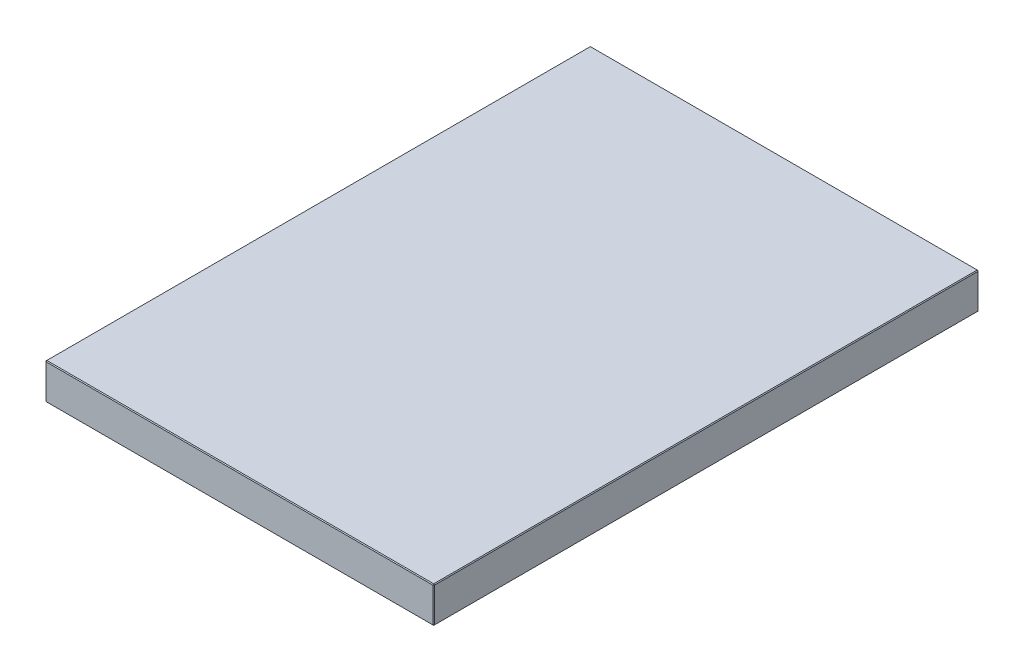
ISO-10303-21;
HEADER;
FILE_DESCRIPTION(('STEP AP214'),'2;1');
FILE_NAME('part.step','',(''),(''),'','','');
FILE_SCHEMA(('AUTOMOTIVE_DESIGN { 1 0 10303 214 1 1 1 1 }'));
ENDSEC;
DATA;
#1=APPLICATION_CONTEXT('core data for automotive mechanical design processes');
#2=APPLICATION_PROTOCOL_DEFINITION('international standard','automotive_design',2000,#1);
#3=PRODUCT_CONTEXT('',#1,'mechanical');
#4=PRODUCT('Part','Part','',(#3));
#5=PRODUCT_RELATED_PRODUCT_CATEGORY('part','',(#4));
#6=PRODUCT_DEFINITION_FORMATION('','',#4);
#7=PRODUCT_DEFINITION_CONTEXT('part definition',#1,'design');
#8=PRODUCT_DEFINITION('design','',#6,#7);
#9=PRODUCT_DEFINITION_SHAPE('','',#8);
#10=(LENGTH_UNIT() NAMED_UNIT(*) SI_UNIT(.MILLI.,.METRE.));
#11=(NAMED_UNIT(*) PLANE_ANGLE_UNIT() SI_UNIT($,.RADIAN.));
#12=(NAMED_UNIT(*) SI_UNIT($,.STERADIAN.) SOLID_ANGLE_UNIT());
#13=UNCERTAINTY_MEASURE_WITH_UNIT(LENGTH_MEASURE(1.E-05),#10,'distance_accuracy_value','');
#14=(GEOMETRIC_REPRESENTATION_CONTEXT(3) GLOBAL_UNCERTAINTY_ASSIGNED_CONTEXT((#13)) GLOBAL_UNIT_ASSIGNED_CONTEXT((#10,
#11,#12)) REPRESENTATION_CONTEXT('',''));
#15=CARTESIAN_POINT('',(0.,0.,0.));
#16=DIRECTION('',(0.,0.,1.));
#17=DIRECTION('',(1.,0.,0.));
#18=AXIS2_PLACEMENT_3D('',#15,#16,#17);
#19=CARTESIAN_POINT('',(-248.,46.,348.));
#20=DIRECTION('',(1.,0.,0.));
#21=DIRECTION('',(0.,0.,-1.));
#22=AXIS2_PLACEMENT_3D('',#19,#20,#21);
#23=PLANE('',#22);
#24=DIRECTION('',(0.,-1.,0.));
#25=VECTOR('',#24,1.);
#26=CARTESIAN_POINT('',(-248.,46.,-347.));
#27=LINE('',#26,#25);
#28=CARTESIAN_POINT('',(-248.,45.,-347.));
#29=VERTEX_POINT('',#28);
#30=CARTESIAN_POINT('',(-248.,1.,-347.));
#31=VERTEX_POINT('',#30);
#32=EDGE_CURVE('E115',#29,#31,#27,.T.);
#33=ORIENTED_EDGE('',*,*,#32,.T.);
#34=DIRECTION('',(0.,0.,1.));
#35=VECTOR('',#34,1.);
#36=CARTESIAN_POINT('',(-248.,1.,348.));
#37=LINE('',#36,#35);
#38=CARTESIAN_POINT('',(-248.,1.,347.));
#39=VERTEX_POINT('',#38);
#40=EDGE_CURVE('E111',#31,#39,#37,.T.);
#41=ORIENTED_EDGE('',*,*,#40,.T.);
#42=DIRECTION('',(0.,1.,0.));
#43=VECTOR('',#42,1.);
#44=CARTESIAN_POINT('',(-248.,46.,347.));
#45=LINE('',#44,#43);
#46=CARTESIAN_POINT('',(-248.,45.,347.));
#47=VERTEX_POINT('',#46);
#48=EDGE_CURVE('E104',#39,#47,#45,.T.);
#49=ORIENTED_EDGE('',*,*,#48,.T.);
#50=DIRECTION('',(0.,0.,-1.));
#51=VECTOR('',#50,1.);
#52=CARTESIAN_POINT('',(-248.,45.,-348.));
#53=LINE('',#52,#51);
#54=EDGE_CURVE('E108',#47,#29,#53,.T.);
#55=ORIENTED_EDGE('',*,*,#54,.T.);
#56=EDGE_LOOP('',(#33,#41,#49,#55));
#57=FACE_BOUND('',#56,.T.);
#58=ADVANCED_FACE('F16',(#57),#23,.F.);
#59=CARTESIAN_POINT('',(248.,46.,348.));
#60=DIRECTION('',(0.,0.,-1.));
#61=DIRECTION('',(-1.,0.,0.));
#62=AXIS2_PLACEMENT_3D('',#59,#60,#61);
#63=PLANE('',#62);
#64=DIRECTION('',(-1.,0.,0.));
#65=VECTOR('',#64,1.);
#66=CARTESIAN_POINT('',(-248.,45.,348.));
#67=LINE('',#66,#65);
#68=CARTESIAN_POINT('',(247.,45.,348.));
#69=VERTEX_POINT('',#68);
#70=CARTESIAN_POINT('',(-247.,45.,348.));
#71=VERTEX_POINT('',#70);
#72=EDGE_CURVE('E165',#69,#71,#67,.T.);
#73=ORIENTED_EDGE('',*,*,#72,.T.);
#74=DIRECTION('',(0.,-1.,0.));
#75=VECTOR('',#74,1.);
#76=CARTESIAN_POINT('',(-247.,46.,348.));
#77=LINE('',#76,#75);
#78=CARTESIAN_POINT('',(-247.,1.,348.));
#79=VERTEX_POINT('',#78);
#80=EDGE_CURVE('E123',#71,#79,#77,.T.);
#81=ORIENTED_EDGE('',*,*,#80,.T.);
#82=DIRECTION('',(1.,0.,0.));
#83=VECTOR('',#82,1.);
#84=CARTESIAN_POINT('',(248.,1.,348.));
#85=LINE('',#84,#83);
#86=CARTESIAN_POINT('',(247.,1.,348.));
#87=VERTEX_POINT('',#86);
#88=EDGE_CURVE('E169',#79,#87,#85,.T.);
#89=ORIENTED_EDGE('',*,*,#88,.T.);
#90=DIRECTION('',(0.,1.,0.));
#91=VECTOR('',#90,1.);
#92=CARTESIAN_POINT('',(247.,46.,348.));
#93=LINE('',#92,#91);
#94=EDGE_CURVE('E167',#87,#69,#93,.T.);
#95=ORIENTED_EDGE('',*,*,#94,.T.);
#96=EDGE_LOOP('',(#73,#81,#89,#95));
#97=FACE_BOUND('',#96,.T.);
#98=ADVANCED_FACE('F276',(#97),#63,.F.);
#99=CARTESIAN_POINT('',(248.,46.,348.));
#100=DIRECTION('',(-1.,0.,0.));
#101=DIRECTION('',(0.,0.,1.));
#102=AXIS2_PLACEMENT_3D('',#99,#100,#101);
#103=PLANE('',#102);
#104=DIRECTION('',(0.,0.,-1.));
#105=VECTOR('',#104,1.);
#106=CARTESIAN_POINT('',(248.,1.,348.));
#107=LINE('',#106,#105);
#108=CARTESIAN_POINT('',(248.,1.,347.));
#109=VERTEX_POINT('',#108);
#110=CARTESIAN_POINT('',(248.,1.,-347.));
#111=VERTEX_POINT('',#110);
#112=EDGE_CURVE('E160',#109,#111,#107,.T.);
#113=ORIENTED_EDGE('',*,*,#112,.T.);
#114=DIRECTION('',(0.,1.,0.));
#115=VECTOR('',#114,1.);
#116=CARTESIAN_POINT('',(248.,46.,-347.));
#117=LINE('',#116,#115);
#118=CARTESIAN_POINT('',(248.,45.,-347.));
#119=VERTEX_POINT('',#118);
#120=EDGE_CURVE('E162',#111,#119,#117,.T.);
#121=ORIENTED_EDGE('',*,*,#120,.T.);
#122=DIRECTION('',(0.,0.,1.));
#123=VECTOR('',#122,1.);
#124=CARTESIAN_POINT('',(248.,45.,348.));
#125=LINE('',#124,#123);
#126=CARTESIAN_POINT('',(248.,45.,347.));
#127=VERTEX_POINT('',#126);
#128=EDGE_CURVE('E156',#119,#127,#125,.T.);
#129=ORIENTED_EDGE('',*,*,#128,.T.);
#130=DIRECTION('',(0.,-1.,0.));
#131=VECTOR('',#130,1.);
#132=CARTESIAN_POINT('',(248.,46.,347.));
#133=LINE('',#132,#131);
#134=EDGE_CURVE('E158',#127,#109,#133,.T.);
#135=ORIENTED_EDGE('',*,*,#134,.T.);
#136=EDGE_LOOP('',(#113,#121,#129,#135));
#137=FACE_BOUND('',#136,.T.);
#138=ADVANCED_FACE('F255',(#137),#103,.F.);
#139=CARTESIAN_POINT('',(248.,46.,-348.));
#140=DIRECTION('',(0.,0.,1.));
#141=DIRECTION('',(1.,0.,0.));
#142=AXIS2_PLACEMENT_3D('',#139,#140,#141);
#143=PLANE('',#142);
#144=DIRECTION('',(0.,-1.,0.));
#145=VECTOR('',#144,1.);
#146=CARTESIAN_POINT('',(247.,46.,-348.));
#147=LINE('',#146,#145);
#148=CARTESIAN_POINT('',(247.,45.,-348.));
#149=VERTEX_POINT('',#148);
#150=CARTESIAN_POINT('',(247.,1.,-348.));
#151=VERTEX_POINT('',#150);
#152=EDGE_CURVE('E149',#149,#151,#147,.T.);
#153=ORIENTED_EDGE('',*,*,#152,.T.);
#154=DIRECTION('',(-1.,0.,0.));
#155=VECTOR('',#154,1.);
#156=CARTESIAN_POINT('',(248.,1.,-348.));
#157=LINE('',#156,#155);
#158=CARTESIAN_POINT('',(-247.,1.,-348.));
#159=VERTEX_POINT('',#158);
#160=EDGE_CURVE('E154',#151,#159,#157,.T.);
#161=ORIENTED_EDGE('',*,*,#160,.T.);
#162=DIRECTION('',(0.,1.,0.));
#163=VECTOR('',#162,1.);
#164=CARTESIAN_POINT('',(-247.,46.,-348.));
#165=LINE('',#164,#163);
#166=CARTESIAN_POINT('',(-247.,45.,-348.));
#167=VERTEX_POINT('',#166);
#168=EDGE_CURVE('E151',#159,#167,#165,.T.);
#169=ORIENTED_EDGE('',*,*,#168,.T.);
#170=DIRECTION('',(1.,0.,0.));
#171=VECTOR('',#170,1.);
#172=CARTESIAN_POINT('',(248.,45.,-348.));
#173=LINE('',#172,#171);
#174=EDGE_CURVE('E147',#167,#149,#173,.T.);
#175=ORIENTED_EDGE('',*,*,#174,.T.);
#176=EDGE_LOOP('',(#153,#161,#169,#175));
#177=FACE_BOUND('',#176,.T.);
#178=ADVANCED_FACE('F285',(#177),#143,.F.);
#179=CARTESIAN_POINT('',(0.,46.,0.));
#180=DIRECTION('',(0.,1.,0.));
#181=DIRECTION('',(0.,0.,1.));
#182=AXIS2_PLACEMENT_3D('',#179,#180,#181);
#183=PLANE('',#182);
#184=DIRECTION('',(0.,0.,-1.));
#185=VECTOR('',#184,1.);
#186=CARTESIAN_POINT('',(247.,46.,-348.));
#187=LINE('',#186,#185);
#188=CARTESIAN_POINT('',(247.,46.,347.));
#189=VERTEX_POINT('',#188);
#190=CARTESIAN_POINT('',(247.,46.,-347.));
#191=VERTEX_POINT('',#190);
#192=EDGE_CURVE('E25',#189,#191,#187,.T.);
#193=ORIENTED_EDGE('',*,*,#192,.T.);
#194=DIRECTION('',(-1.,0.,0.));
#195=VECTOR('',#194,1.);
#196=CARTESIAN_POINT('',(-248.,46.,-347.));
#197=LINE('',#196,#195);
#198=CARTESIAN_POINT('',(-247.,46.,-347.));
#199=VERTEX_POINT('',#198);
#200=EDGE_CURVE('E10',#191,#199,#197,.T.);
#201=ORIENTED_EDGE('',*,*,#200,.T.);
#202=DIRECTION('',(0.,0.,1.));
#203=VECTOR('',#202,1.);
#204=CARTESIAN_POINT('',(-247.,46.,348.));
#205=LINE('',#204,#203);
#206=CARTESIAN_POINT('',(-247.,46.,347.));
#207=VERTEX_POINT('',#206);
#208=EDGE_CURVE('E181',#199,#207,#205,.T.);
#209=ORIENTED_EDGE('',*,*,#208,.T.);
#210=DIRECTION('',(1.,0.,0.));
#211=VECTOR('',#210,1.);
#212=CARTESIAN_POINT('',(248.,46.,347.));
#213=LINE('',#212,#211);
#214=EDGE_CURVE('E36',#207,#189,#213,.T.);
#215=ORIENTED_EDGE('',*,*,#214,.T.);
#216=EDGE_LOOP('',(#193,#201,#209,#215));
#217=FACE_BOUND('',#216,.T.);
#218=ADVANCED_FACE('F351',(#217),#183,.T.);
#219=CARTESIAN_POINT('',(0.,0.,0.));
#220=DIRECTION('',(0.,1.,0.));
#221=DIRECTION('',(0.,0.,1.));
#222=AXIS2_PLACEMENT_3D('',#219,#220,#221);
#223=PLANE('',#222);
#224=DIRECTION('',(0.,0.,1.));
#225=VECTOR('',#224,1.);
#226=CARTESIAN_POINT('',(247.,0.,0.));
#227=LINE('',#226,#225);
#228=CARTESIAN_POINT('',(247.,0.,-347.));
#229=VERTEX_POINT('',#228);
#230=CARTESIAN_POINT('',(247.,0.,347.));
#231=VERTEX_POINT('',#230);
#232=EDGE_CURVE('E172',#229,#231,#227,.T.);
#233=ORIENTED_EDGE('',*,*,#232,.T.);
#234=DIRECTION('',(-1.,0.,0.));
#235=VECTOR('',#234,1.);
#236=CARTESIAN_POINT('',(0.,0.,347.));
#237=LINE('',#236,#235);
#238=CARTESIAN_POINT('',(-247.,0.,347.));
#239=VERTEX_POINT('',#238);
#240=EDGE_CURVE('E178',#231,#239,#237,.T.);
#241=ORIENTED_EDGE('',*,*,#240,.T.);
#242=DIRECTION('',(0.,0.,-1.));
#243=VECTOR('',#242,1.);
#244=CARTESIAN_POINT('',(-247.,0.,0.));
#245=LINE('',#244,#243);
#246=CARTESIAN_POINT('',(-247.,0.,-347.));
#247=VERTEX_POINT('',#246);
#248=EDGE_CURVE('E176',#239,#247,#245,.T.);
#249=ORIENTED_EDGE('',*,*,#248,.T.);
#250=DIRECTION('',(1.,0.,0.));
#251=VECTOR('',#250,1.);
#252=CARTESIAN_POINT('',(-1.16506266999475E-13,0.,-347.));
#253=LINE('',#252,#251);
#254=EDGE_CURVE('E174',#247,#229,#253,.T.);
#255=ORIENTED_EDGE('',*,*,#254,.T.);
#256=EDGE_LOOP('',(#233,#241,#249,#255));
#257=FACE_BOUND('',#256,.T.);
#258=ADVANCED_FACE('F247',(#257),#223,.F.);
#259=CARTESIAN_POINT('',(248.,46.,347.));
#260=DIRECTION('',(-0.707106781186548,0.,-0.707106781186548));
#261=DIRECTION('',(0.,-1.,0.));
#262=AXIS2_PLACEMENT_3D('',#259,#260,#261);
#263=PLANE('',#262);
#264=DIRECTION('',(-0.707106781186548,0.,0.707106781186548));
#265=VECTOR('',#264,1.);
#266=CARTESIAN_POINT('',(247.,45.,348.));
#267=LINE('',#266,#265);
#268=EDGE_CURVE('E20',#69,#127,#267,.F.);
#269=ORIENTED_EDGE('',*,*,#268,.F.);
#270=ORIENTED_EDGE('',*,*,#94,.F.);
#271=DIRECTION('',(0.707106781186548,0.,-0.707106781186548));
#272=VECTOR('',#271,1.);
#273=CARTESIAN_POINT('',(247.,1.,348.));
#274=LINE('',#273,#272);
#275=EDGE_CURVE('E143',#109,#87,#274,.F.);
#276=ORIENTED_EDGE('',*,*,#275,.F.);
#277=ORIENTED_EDGE('',*,*,#134,.F.);
#278=EDGE_LOOP('',(#269,#270,#276,#277));
#279=FACE_BOUND('',#278,.T.);
#280=ADVANCED_FACE('F18',(#279),#263,.F.);
#281=CARTESIAN_POINT('',(247.,45.,348.));
#282=DIRECTION('',(0.577350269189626,0.577350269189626,0.577350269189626));
#283=DIRECTION('',(0.707106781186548,0.,-0.707106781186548));
#284=AXIS2_PLACEMENT_3D('',#281,#282,#283);
#285=PLANE('',#284);
#286=DIRECTION('',(0.,-0.707106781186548,0.707106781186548));
#287=VECTOR('',#286,1.);
#288=CARTESIAN_POINT('',(247.,45.,348.));
#289=LINE('',#288,#287);
#290=EDGE_CURVE('E227',#69,#189,#289,.F.);
#291=ORIENTED_EDGE('',*,*,#290,.F.);
#292=ORIENTED_EDGE('',*,*,#268,.T.);
#293=DIRECTION('',(-0.707106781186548,0.707106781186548,0.));
#294=VECTOR('',#293,1.);
#295=CARTESIAN_POINT('',(247.5,45.5,347.));
#296=LINE('',#295,#294);
#297=EDGE_CURVE('E229',#189,#127,#296,.F.);
#298=ORIENTED_EDGE('',*,*,#297,.F.);
#299=EDGE_LOOP('',(#291,#292,#298));
#300=FACE_BOUND('',#299,.T.);
#301=ADVANCED_FACE('F271',(#300),#285,.T.);
#302=CARTESIAN_POINT('',(247.,1.,348.));
#303=DIRECTION('',(0.577350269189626,-0.577350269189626,0.577350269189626));
#304=DIRECTION('',(0.707106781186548,0.,-0.707106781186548));
#305=AXIS2_PLACEMENT_3D('',#302,#303,#304);
#306=PLANE('',#305);
#307=DIRECTION('',(-0.707106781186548,-0.707106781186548,0.));
#308=VECTOR('',#307,1.);
#309=CARTESIAN_POINT('',(247.5,0.5,347.));
#310=LINE('',#309,#308);
#311=EDGE_CURVE('E221',#109,#231,#310,.T.);
#312=ORIENTED_EDGE('',*,*,#311,.F.);
#313=ORIENTED_EDGE('',*,*,#275,.T.);
#314=DIRECTION('',(0.,0.707106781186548,0.707106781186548));
#315=VECTOR('',#314,1.);
#316=CARTESIAN_POINT('',(247.,1.,348.));
#317=LINE('',#316,#315);
#318=EDGE_CURVE('E224',#231,#87,#317,.T.);
#319=ORIENTED_EDGE('',*,*,#318,.F.);
#320=EDGE_LOOP('',(#312,#313,#319));
#321=FACE_BOUND('',#320,.T.);
#322=ADVANCED_FACE('F236',(#321),#306,.T.);
#323=CARTESIAN_POINT('',(247.,46.,0.));
#324=DIRECTION('',(0.707106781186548,0.707106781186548,0.));
#325=DIRECTION('',(0.,0.,1.));
#326=AXIS2_PLACEMENT_3D('',#323,#324,#325);
#327=PLANE('',#326);
#328=ORIENTED_EDGE('',*,*,#297,.T.);
#329=ORIENTED_EDGE('',*,*,#128,.F.);
#330=DIRECTION('',(0.707106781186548,-0.707106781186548,0.));
#331=VECTOR('',#330,1.);
#332=CARTESIAN_POINT('',(248.,45.,-347.));
#333=LINE('',#332,#331);
#334=EDGE_CURVE('E216',#191,#119,#333,.T.);
#335=ORIENTED_EDGE('',*,*,#334,.F.);
#336=ORIENTED_EDGE('',*,*,#192,.F.);
#337=EDGE_LOOP('',(#328,#329,#335,#336));
#338=FACE_BOUND('',#337,.T.);
#339=ADVANCED_FACE('F266',(#338),#327,.T.);
#340=CARTESIAN_POINT('',(0.,46.,347.));
#341=DIRECTION('',(0.,0.707106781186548,0.707106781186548));
#342=DIRECTION('',(-1.,0.,0.));
#343=AXIS2_PLACEMENT_3D('',#340,#341,#342);
#344=PLANE('',#343);
#345=ORIENTED_EDGE('',*,*,#290,.T.);
#346=ORIENTED_EDGE('',*,*,#214,.F.);
#347=DIRECTION('',(0.,0.707106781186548,-0.707106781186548));
#348=VECTOR('',#347,1.);
#349=CARTESIAN_POINT('',(-247.,45.5,347.5));
#350=LINE('',#349,#348);
#351=EDGE_CURVE('E127',#71,#207,#350,.T.);
#352=ORIENTED_EDGE('',*,*,#351,.F.);
#353=ORIENTED_EDGE('',*,*,#72,.F.);
#354=EDGE_LOOP('',(#345,#346,#352,#353));
#355=FACE_BOUND('',#354,.T.);
#356=ADVANCED_FACE('F274',(#355),#344,.T.);
#357=CARTESIAN_POINT('',(-247.,46.,348.));
#358=DIRECTION('',(0.707106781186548,0.,-0.707106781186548));
#359=DIRECTION('',(0.,-1.,0.));
#360=AXIS2_PLACEMENT_3D('',#357,#358,#359);
#361=PLANE('',#360);
#362=DIRECTION('',(0.707106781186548,0.,0.707106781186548));
#363=VECTOR('',#362,1.);
#364=CARTESIAN_POINT('',(-247.,1.,348.));
#365=LINE('',#364,#363);
#366=EDGE_CURVE('E128',#79,#39,#365,.F.);
#367=ORIENTED_EDGE('',*,*,#366,.F.);
#368=ORIENTED_EDGE('',*,*,#80,.F.);
#369=DIRECTION('',(-0.707106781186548,0.,-0.707106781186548));
#370=VECTOR('',#369,1.);
#371=CARTESIAN_POINT('',(-248.,45.,347.));
#372=LINE('',#371,#370);
#373=EDGE_CURVE('E119',#47,#71,#372,.F.);
#374=ORIENTED_EDGE('',*,*,#373,.F.);
#375=ORIENTED_EDGE('',*,*,#48,.F.);
#376=EDGE_LOOP('',(#367,#368,#374,#375));
#377=FACE_BOUND('',#376,.T.);
#378=ADVANCED_FACE('F121',(#377),#361,.F.);
#379=CARTESIAN_POINT('',(248.,1.,348.));
#380=DIRECTION('',(0.,0.707106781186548,-0.707106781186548));
#381=DIRECTION('',(1.,0.,0.));
#382=AXIS2_PLACEMENT_3D('',#379,#380,#381);
#383=PLANE('',#382);
#384=ORIENTED_EDGE('',*,*,#318,.T.);
#385=ORIENTED_EDGE('',*,*,#88,.F.);
#386=DIRECTION('',(0.,-0.707106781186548,-0.707106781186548));
#387=VECTOR('',#386,1.);
#388=CARTESIAN_POINT('',(-247.,1.,348.));
#389=LINE('',#388,#387);
#390=EDGE_CURVE('E212',#239,#79,#389,.F.);
#391=ORIENTED_EDGE('',*,*,#390,.F.);
#392=ORIENTED_EDGE('',*,*,#240,.F.);
#393=EDGE_LOOP('',(#384,#385,#391,#392));
#394=FACE_BOUND('',#393,.T.);
#395=ADVANCED_FACE('F244',(#394),#383,.F.);
#396=CARTESIAN_POINT('',(248.,1.,348.));
#397=DIRECTION('',(-0.707106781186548,0.707106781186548,0.));
#398=DIRECTION('',(0.,0.,-1.));
#399=AXIS2_PLACEMENT_3D('',#396,#397,#398);
#400=PLANE('',#399);
#401=ORIENTED_EDGE('',*,*,#311,.T.);
#402=ORIENTED_EDGE('',*,*,#232,.F.);
#403=DIRECTION('',(0.707106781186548,0.707106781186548,0.));
#404=VECTOR('',#403,1.);
#405=CARTESIAN_POINT('',(247.5,0.500000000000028,-347.));
#406=LINE('',#405,#404);
#407=EDGE_CURVE('E209',#111,#229,#406,.F.);
#408=ORIENTED_EDGE('',*,*,#407,.F.);
#409=ORIENTED_EDGE('',*,*,#112,.F.);
#410=EDGE_LOOP('',(#401,#402,#408,#409));
#411=FACE_BOUND('',#410,.T.);
#412=ADVANCED_FACE('F252',(#411),#400,.F.);
#413=CARTESIAN_POINT('',(247.,46.,-348.));
#414=DIRECTION('',(-0.707106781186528,0.,0.707106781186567));
#415=DIRECTION('',(0.,-1.,0.));
#416=AXIS2_PLACEMENT_3D('',#413,#414,#415);
#417=PLANE('',#416);
#418=DIRECTION('',(0.707106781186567,0.,0.707106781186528));
#419=VECTOR('',#418,1.);
#420=CARTESIAN_POINT('',(248.,45.,-347.));
#421=LINE('',#420,#419);
#422=EDGE_CURVE('E218',#119,#149,#421,.F.);
#423=ORIENTED_EDGE('',*,*,#422,.F.);
#424=ORIENTED_EDGE('',*,*,#120,.F.);
#425=DIRECTION('',(-0.707106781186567,0.,-0.707106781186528));
#426=VECTOR('',#425,1.);
#427=CARTESIAN_POINT('',(247.,1.,-348.));
#428=LINE('',#427,#426);
#429=EDGE_CURVE('E206',#151,#111,#428,.F.);
#430=ORIENTED_EDGE('',*,*,#429,.F.);
#431=ORIENTED_EDGE('',*,*,#152,.F.);
#432=EDGE_LOOP('',(#423,#424,#430,#431));
#433=FACE_BOUND('',#432,.T.);
#434=ADVANCED_FACE('F259',(#433),#417,.F.);
#435=CARTESIAN_POINT('',(248.,45.,-347.));
#436=DIRECTION('',(0.577350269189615,0.577350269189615,-0.577350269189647));
#437=DIRECTION('',(-0.707106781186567,0.,-0.707106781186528));
#438=AXIS2_PLACEMENT_3D('',#435,#436,#437);
#439=PLANE('',#438);
#440=ORIENTED_EDGE('',*,*,#334,.T.);
#441=ORIENTED_EDGE('',*,*,#422,.T.);
#442=DIRECTION('',(0.,0.707106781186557,0.707106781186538));
#443=VECTOR('',#442,1.);
#444=CARTESIAN_POINT('',(247.,45.5,-347.5));
#445=LINE('',#444,#443);
#446=EDGE_CURVE('E135',#191,#149,#445,.F.);
#447=ORIENTED_EDGE('',*,*,#446,.F.);
#448=EDGE_LOOP('',(#440,#441,#447));
#449=FACE_BOUND('',#448,.T.);
#450=ADVANCED_FACE('F326',(#449),#439,.T.);
#451=CARTESIAN_POINT('',(-248.,45.,347.));
#452=DIRECTION('',(-0.577350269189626,0.577350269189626,0.577350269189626));
#453=DIRECTION('',(0.707106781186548,0.,0.707106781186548));
#454=AXIS2_PLACEMENT_3D('',#451,#452,#453);
#455=PLANE('',#454);
#456=ORIENTED_EDGE('',*,*,#373,.T.);
#457=ORIENTED_EDGE('',*,*,#351,.T.);
#458=DIRECTION('',(-0.707106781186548,-0.707106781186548,0.));
#459=VECTOR('',#458,1.);
#460=CARTESIAN_POINT('',(-248.,45.,347.));
#461=LINE('',#460,#459);
#462=EDGE_CURVE('E131',#47,#207,#461,.F.);
#463=ORIENTED_EDGE('',*,*,#462,.F.);
#464=EDGE_LOOP('',(#456,#457,#463));
#465=FACE_BOUND('',#464,.T.);
#466=ADVANCED_FACE('F132',(#465),#455,.T.);
#467=CARTESIAN_POINT('',(-247.,1.,348.));
#468=DIRECTION('',(-0.577350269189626,-0.577350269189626,0.577350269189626));
#469=DIRECTION('',(0.707106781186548,0.,0.707106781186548));
#470=AXIS2_PLACEMENT_3D('',#467,#468,#469);
#471=PLANE('',#470);
#472=ORIENTED_EDGE('',*,*,#390,.T.);
#473=ORIENTED_EDGE('',*,*,#366,.T.);
#474=DIRECTION('',(-0.707106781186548,0.707106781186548,0.));
#475=VECTOR('',#474,1.);
#476=CARTESIAN_POINT('',(-247.5,0.5,347.));
#477=LINE('',#476,#475);
#478=EDGE_CURVE('E136',#239,#39,#477,.T.);
#479=ORIENTED_EDGE('',*,*,#478,.F.);
#480=EDGE_LOOP('',(#472,#473,#479));
#481=FACE_BOUND('',#480,.T.);
#482=ADVANCED_FACE('F319',(#481),#471,.T.);
#483=CARTESIAN_POINT('',(247.,1.,-348.));
#484=DIRECTION('',(0.577350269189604,-0.577350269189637,-0.577350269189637));
#485=DIRECTION('',(0.,0.707106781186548,-0.707106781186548));
#486=AXIS2_PLACEMENT_3D('',#483,#484,#485);
#487=PLANE('',#486);
#488=ORIENTED_EDGE('',*,*,#429,.T.);
#489=ORIENTED_EDGE('',*,*,#407,.T.);
#490=DIRECTION('',(0.,-0.707106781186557,0.707106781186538));
#491=VECTOR('',#490,1.);
#492=CARTESIAN_POINT('',(247.,1.,-348.));
#493=LINE('',#492,#491);
#494=EDGE_CURVE('E199',#151,#229,#493,.T.);
#495=ORIENTED_EDGE('',*,*,#494,.F.);
#496=EDGE_LOOP('',(#488,#489,#495));
#497=FACE_BOUND('',#496,.T.);
#498=ADVANCED_FACE('F315',(#497),#487,.T.);
#499=CARTESIAN_POINT('',(-1.16506266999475E-13,46.,-347.));
#500=DIRECTION('',(0.,0.707106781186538,-0.707106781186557));
#501=DIRECTION('',(1.,0.,0.));
#502=AXIS2_PLACEMENT_3D('',#499,#500,#501);
#503=PLANE('',#502);
#504=ORIENTED_EDGE('',*,*,#446,.T.);
#505=ORIENTED_EDGE('',*,*,#174,.F.);
#506=DIRECTION('',(0.,-0.707106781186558,-0.707106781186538));
#507=VECTOR('',#506,1.);
#508=CARTESIAN_POINT('',(-247.,45.,-348.));
#509=LINE('',#508,#507);
#510=EDGE_CURVE('E196',#199,#167,#509,.T.);
#511=ORIENTED_EDGE('',*,*,#510,.F.);
#512=ORIENTED_EDGE('',*,*,#200,.F.);
#513=EDGE_LOOP('',(#504,#505,#511,#512));
#514=FACE_BOUND('',#513,.T.);
#515=ADVANCED_FACE('F312',(#514),#503,.T.);
#516=CARTESIAN_POINT('',(-247.,46.,0.));
#517=DIRECTION('',(-0.707106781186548,0.707106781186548,0.));
#518=DIRECTION('',(0.,0.,-1.));
#519=AXIS2_PLACEMENT_3D('',#516,#517,#518);
#520=PLANE('',#519);
#521=ORIENTED_EDGE('',*,*,#462,.T.);
#522=ORIENTED_EDGE('',*,*,#208,.F.);
#523=DIRECTION('',(0.707106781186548,0.707106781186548,-1.17767360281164E-13));
#524=VECTOR('',#523,1.);
#525=CARTESIAN_POINT('',(-247.5,45.5,-347.));
#526=LINE('',#525,#524);
#527=EDGE_CURVE('E139',#29,#199,#526,.T.);
#528=ORIENTED_EDGE('',*,*,#527,.F.);
#529=ORIENTED_EDGE('',*,*,#54,.F.);
#530=EDGE_LOOP('',(#521,#522,#528,#529));
#531=FACE_BOUND('',#530,.T.);
#532=ADVANCED_FACE('F138',(#531),#520,.T.);
#533=CARTESIAN_POINT('',(-248.,1.,348.));
#534=DIRECTION('',(0.707106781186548,0.707106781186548,0.));
#535=DIRECTION('',(0.,0.,1.));
#536=AXIS2_PLACEMENT_3D('',#533,#534,#535);
#537=PLANE('',#536);
#538=ORIENTED_EDGE('',*,*,#478,.T.);
#539=ORIENTED_EDGE('',*,*,#40,.F.);
#540=DIRECTION('',(0.707106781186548,-0.707106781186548,0.));
#541=VECTOR('',#540,1.);
#542=CARTESIAN_POINT('',(-248.,1.,-347.));
#543=LINE('',#542,#541);
#544=EDGE_CURVE('E192',#247,#31,#543,.F.);
#545=ORIENTED_EDGE('',*,*,#544,.F.);
#546=ORIENTED_EDGE('',*,*,#248,.F.);
#547=EDGE_LOOP('',(#538,#539,#545,#546));
#548=FACE_BOUND('',#547,.T.);
#549=ADVANCED_FACE('F305',(#548),#537,.F.);
#550=CARTESIAN_POINT('',(248.,1.,-348.));
#551=DIRECTION('',(0.,0.707106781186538,0.707106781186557));
#552=DIRECTION('',(-1.,0.,0.));
#553=AXIS2_PLACEMENT_3D('',#550,#551,#552);
#554=PLANE('',#553);
#555=ORIENTED_EDGE('',*,*,#494,.T.);
#556=ORIENTED_EDGE('',*,*,#254,.F.);
#557=DIRECTION('',(0.,0.707106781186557,-0.707106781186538));
#558=VECTOR('',#557,1.);
#559=CARTESIAN_POINT('',(-247.,0.499999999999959,-347.5));
#560=LINE('',#559,#558);
#561=EDGE_CURVE('E189',#159,#247,#560,.F.);
#562=ORIENTED_EDGE('',*,*,#561,.F.);
#563=ORIENTED_EDGE('',*,*,#160,.F.);
#564=EDGE_LOOP('',(#555,#556,#562,#563));
#565=FACE_BOUND('',#564,.T.);
#566=ADVANCED_FACE('F301',(#565),#554,.F.);
#567=CARTESIAN_POINT('',(-247.,45.,-348.));
#568=DIRECTION('',(-0.577350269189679,0.577350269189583,-0.577350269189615));
#569=DIRECTION('',(-0.707106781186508,0.,0.707106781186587));
#570=AXIS2_PLACEMENT_3D('',#567,#568,#569);
#571=PLANE('',#570);
#572=ORIENTED_EDGE('',*,*,#527,.T.);
#573=ORIENTED_EDGE('',*,*,#510,.T.);
#574=DIRECTION('',(0.707106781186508,0.,-0.707106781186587));
#575=VECTOR('',#574,1.);
#576=CARTESIAN_POINT('',(-247.,45.,-348.));
#577=LINE('',#576,#575);
#578=EDGE_CURVE('E187',#29,#167,#577,.T.);
#579=ORIENTED_EDGE('',*,*,#578,.F.);
#580=EDGE_LOOP('',(#572,#573,#579));
#581=FACE_BOUND('',#580,.T.);
#582=ADVANCED_FACE('F297',(#581),#571,.T.);
#583=CARTESIAN_POINT('',(-248.,1.,-347.));
#584=DIRECTION('',(-0.577350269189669,-0.577350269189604,-0.577350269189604));
#585=DIRECTION('',(-0.707106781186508,0.,0.707106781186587));
#586=AXIS2_PLACEMENT_3D('',#583,#584,#585);
#587=PLANE('',#586);
#588=ORIENTED_EDGE('',*,*,#561,.T.);
#589=ORIENTED_EDGE('',*,*,#544,.T.);
#590=DIRECTION('',(-0.707106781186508,0.,0.707106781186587));
#591=VECTOR('',#590,1.);
#592=CARTESIAN_POINT('',(-248.,1.,-347.));
#593=LINE('',#592,#591);
#594=EDGE_CURVE('E185',#159,#31,#593,.T.);
#595=ORIENTED_EDGE('',*,*,#594,.F.);
#596=EDGE_LOOP('',(#588,#589,#595));
#597=FACE_BOUND('',#596,.T.);
#598=ADVANCED_FACE('F293',(#597),#587,.T.);
#599=CARTESIAN_POINT('',(-248.,46.,-347.));
#600=DIRECTION('',(0.707106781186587,0.,0.707106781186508));
#601=DIRECTION('',(0.,-1.,0.));
#602=AXIS2_PLACEMENT_3D('',#599,#600,#601);
#603=PLANE('',#602);
#604=ORIENTED_EDGE('',*,*,#578,.T.);
#605=ORIENTED_EDGE('',*,*,#168,.F.);
#606=ORIENTED_EDGE('',*,*,#594,.T.);
#607=ORIENTED_EDGE('',*,*,#32,.F.);
#608=EDGE_LOOP('',(#604,#605,#606,#607));
#609=FACE_BOUND('',#608,.T.);
#610=ADVANCED_FACE('F290',(#609),#603,.F.);
#611=CLOSED_SHELL('',(#58,#98,#138,#178,#218,#258,#280,#301,#322,#339,#356,#378,#395,#412,#434,
#450,#466,#482,#498,#515,#532,#549,#566,#582,#598,#610));
#612=MANIFOLD_SOLID_BREP('B1',#611);
#613=ADVANCED_BREP_SHAPE_REPRESENTATION('',(#18,#612),#14);
#614=SHAPE_DEFINITION_REPRESENTATION(#9,#613);
ENDSEC;
END-ISO-10303-21;
